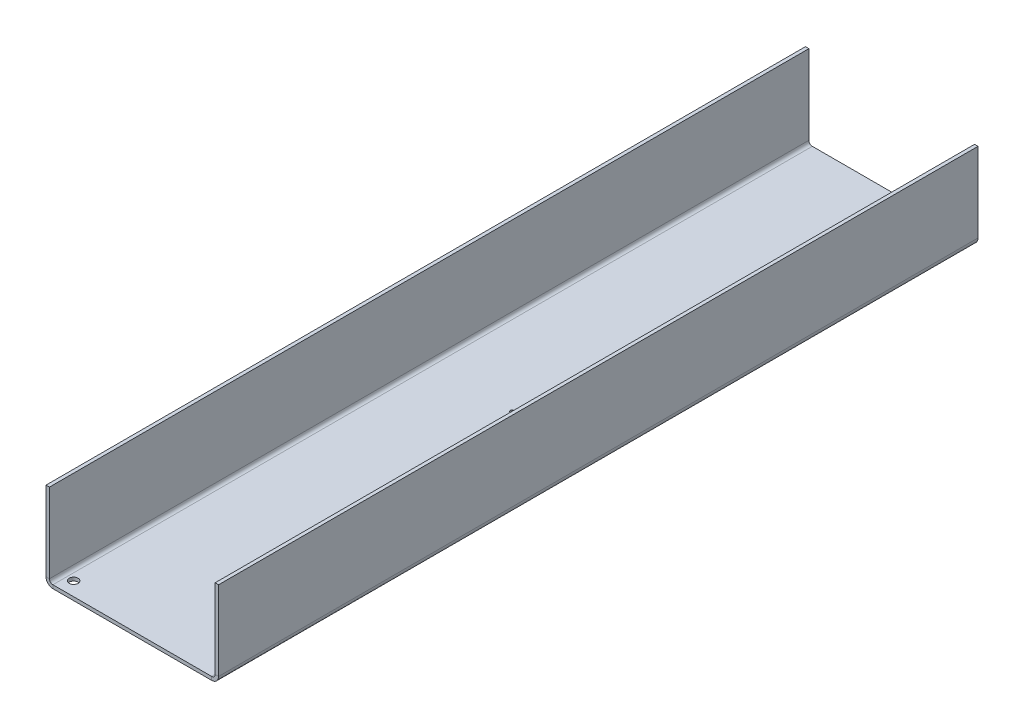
ISO-10303-21;
HEADER;
FILE_DESCRIPTION(('STEP AP214'),'2;1');
FILE_NAME('part.step','',(''),(''),'','','');
FILE_SCHEMA(('AUTOMOTIVE_DESIGN { 1 0 10303 214 1 1 1 1 }'));
ENDSEC;
DATA;
#1=APPLICATION_CONTEXT('core data for automotive mechanical design processes');
#2=APPLICATION_PROTOCOL_DEFINITION('international standard','automotive_design',2000,#1);
#3=PRODUCT_CONTEXT('',#1,'mechanical');
#4=PRODUCT('Part','Part','',(#3));
#5=PRODUCT_RELATED_PRODUCT_CATEGORY('part','',(#4));
#6=PRODUCT_DEFINITION_FORMATION('','',#4);
#7=PRODUCT_DEFINITION_CONTEXT('part definition',#1,'design');
#8=PRODUCT_DEFINITION('design','',#6,#7);
#9=PRODUCT_DEFINITION_SHAPE('','',#8);
#10=(LENGTH_UNIT() NAMED_UNIT(*) SI_UNIT(.MILLI.,.METRE.));
#11=(NAMED_UNIT(*) PLANE_ANGLE_UNIT() SI_UNIT($,.RADIAN.));
#12=(NAMED_UNIT(*) SI_UNIT($,.STERADIAN.) SOLID_ANGLE_UNIT());
#13=UNCERTAINTY_MEASURE_WITH_UNIT(LENGTH_MEASURE(1.E-05),#10,'distance_accuracy_value','');
#14=(GEOMETRIC_REPRESENTATION_CONTEXT(3) GLOBAL_UNCERTAINTY_ASSIGNED_CONTEXT((#13)) GLOBAL_UNIT_ASSIGNED_CONTEXT((#10,
#11,#12)) REPRESENTATION_CONTEXT('',''));
#15=CARTESIAN_POINT('',(0.,0.,0.));
#16=DIRECTION('',(0.,0.,1.));
#17=DIRECTION('',(1.,0.,0.));
#18=AXIS2_PLACEMENT_3D('',#15,#16,#17);
#19=CARTESIAN_POINT('',(0.,-115.,1100.));
#20=DIRECTION('',(0.,0.,1.));
#21=DIRECTION('',(1.,0.,0.));
#22=AXIS2_PLACEMENT_3D('',#19,#20,#21);
#23=PLANE('',#22);
#24=DIRECTION('',(1.,0.,0.));
#25=VECTOR('',#24,1.);
#26=CARTESIAN_POINT('',(0.,-115.,1100.));
#27=LINE('',#26,#25);
#28=CARTESIAN_POINT('',(0.,-115.,1100.));
#29=VERTEX_POINT('',#28);
#30=CARTESIAN_POINT('',(5.00000000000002,-115.,1100.));
#31=VERTEX_POINT('',#30);
#32=EDGE_CURVE('E11',#29,#31,#27,.T.);
#33=ORIENTED_EDGE('',*,*,#32,.F.);
#34=CARTESIAN_POINT('',(10.,-115.,1100.));
#35=DIRECTION('',(0.,0.,1.));
#36=DIRECTION('',(-1.,0.,0.));
#37=AXIS2_PLACEMENT_3D('',#34,#35,#36);
#38=CIRCLE('',#37,9.99999999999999);
#39=CARTESIAN_POINT('',(10.,-125.,1100.));
#40=VERTEX_POINT('',#39);
#41=EDGE_CURVE('E202',#29,#40,#38,.T.);
#42=ORIENTED_EDGE('',*,*,#41,.T.);
#43=DIRECTION('',(0.,-1.,0.));
#44=VECTOR('',#43,1.);
#45=CARTESIAN_POINT('',(10.,-120.,1100.));
#46=LINE('',#45,#44);
#47=CARTESIAN_POINT('',(10.,-120.,1100.));
#48=VERTEX_POINT('',#47);
#49=EDGE_CURVE('E41',#48,#40,#46,.T.);
#50=ORIENTED_EDGE('',*,*,#49,.F.);
#51=CARTESIAN_POINT('',(10.,-115.,1100.));
#52=DIRECTION('',(0.,0.,1.));
#53=DIRECTION('',(1.,0.,0.));
#54=AXIS2_PLACEMENT_3D('',#51,#52,#53);
#55=CIRCLE('',#54,4.99999999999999);
#56=EDGE_CURVE('E190',#31,#48,#55,.T.);
#57=ORIENTED_EDGE('',*,*,#56,.F.);
#58=EDGE_LOOP('',(#33,#42,#50,#57));
#59=FACE_BOUND('',#58,.T.);
#60=ADVANCED_FACE('F34',(#59),#23,.T.);
#61=CARTESIAN_POINT('',(10.,-120.,1100.));
#62=DIRECTION('',(0.,0.,1.));
#63=DIRECTION('',(1.,0.,0.));
#64=AXIS2_PLACEMENT_3D('',#61,#62,#63);
#65=PLANE('',#64);
#66=DIRECTION('',(0.,-1.,0.));
#67=VECTOR('',#66,1.);
#68=CARTESIAN_POINT('',(0.,0.,1100.));
#69=LINE('',#68,#67);
#70=CARTESIAN_POINT('',(0.,0.,1100.));
#71=VERTEX_POINT('',#70);
#72=EDGE_CURVE('E199',#71,#29,#69,.T.);
#73=ORIENTED_EDGE('',*,*,#72,.T.);
#74=ORIENTED_EDGE('',*,*,#32,.T.);
#75=DIRECTION('',(0.,-1.,0.));
#76=VECTOR('',#75,1.);
#77=CARTESIAN_POINT('',(5.,0.,1100.));
#78=LINE('',#77,#76);
#79=CARTESIAN_POINT('',(5.,0.,1100.));
#80=VERTEX_POINT('',#79);
#81=EDGE_CURVE('E193',#80,#31,#78,.T.);
#82=ORIENTED_EDGE('',*,*,#81,.F.);
#83=DIRECTION('',(1.,0.,0.));
#84=VECTOR('',#83,1.);
#85=CARTESIAN_POINT('',(0.,0.,1100.));
#86=LINE('',#85,#84);
#87=EDGE_CURVE('E196',#71,#80,#86,.T.);
#88=ORIENTED_EDGE('',*,*,#87,.F.);
#89=EDGE_LOOP('',(#73,#74,#82,#88));
#90=FACE_BOUND('',#89,.T.);
#91=ADVANCED_FACE('F286',(#90),#65,.T.);
#92=CARTESIAN_POINT('',(10.,-125.,0.));
#93=DIRECTION('',(0.,0.,-1.));
#94=DIRECTION('',(-1.,0.,0.));
#95=AXIS2_PLACEMENT_3D('',#92,#93,#94);
#96=PLANE('',#95);
#97=DIRECTION('',(0.,1.,0.));
#98=VECTOR('',#97,1.);
#99=CARTESIAN_POINT('',(10.,-125.,0.));
#100=LINE('',#99,#98);
#101=CARTESIAN_POINT('',(10.,-125.,0.));
#102=VERTEX_POINT('',#101);
#103=CARTESIAN_POINT('',(10.,-120.,0.));
#104=VERTEX_POINT('',#103);
#105=EDGE_CURVE('E243',#102,#104,#100,.T.);
#106=ORIENTED_EDGE('',*,*,#105,.F.);
#107=CARTESIAN_POINT('',(10.,-115.,0.));
#108=DIRECTION('',(0.,0.,1.));
#109=DIRECTION('',(-1.,0.,0.));
#110=AXIS2_PLACEMENT_3D('',#107,#108,#109);
#111=CIRCLE('',#110,9.99999999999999);
#112=CARTESIAN_POINT('',(0.,-115.,0.));
#113=VERTEX_POINT('',#112);
#114=EDGE_CURVE('E169',#113,#102,#111,.T.);
#115=ORIENTED_EDGE('',*,*,#114,.F.);
#116=DIRECTION('',(-1.,0.,0.));
#117=VECTOR('',#116,1.);
#118=CARTESIAN_POINT('',(5.00000000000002,-115.,0.));
#119=LINE('',#118,#117);
#120=CARTESIAN_POINT('',(5.00000000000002,-115.,0.));
#121=VERTEX_POINT('',#120);
#122=EDGE_CURVE('E241',#121,#113,#119,.T.);
#123=ORIENTED_EDGE('',*,*,#122,.F.);
#124=CARTESIAN_POINT('',(10.,-115.,0.));
#125=DIRECTION('',(0.,0.,1.));
#126=DIRECTION('',(1.,0.,0.));
#127=AXIS2_PLACEMENT_3D('',#124,#125,#126);
#128=CIRCLE('',#127,4.99999999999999);
#129=EDGE_CURVE('E157',#121,#104,#128,.T.);
#130=ORIENTED_EDGE('',*,*,#129,.T.);
#131=EDGE_LOOP('',(#106,#115,#123,#130));
#132=FACE_BOUND('',#131,.T.);
#133=ADVANCED_FACE('F296',(#132),#96,.T.);
#134=CARTESIAN_POINT('',(5.00000000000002,-115.,0.));
#135=DIRECTION('',(0.,0.,-1.));
#136=DIRECTION('',(-1.,0.,0.));
#137=AXIS2_PLACEMENT_3D('',#134,#135,#136);
#138=PLANE('',#137);
#139=DIRECTION('',(1.,0.,0.));
#140=VECTOR('',#139,1.);
#141=CARTESIAN_POINT('',(10.,-125.,0.));
#142=LINE('',#141,#140);
#143=CARTESIAN_POINT('',(240.,-125.,0.));
#144=VERTEX_POINT('',#143);
#145=EDGE_CURVE('E172',#102,#144,#142,.T.);
#146=ORIENTED_EDGE('',*,*,#145,.F.);
#147=ORIENTED_EDGE('',*,*,#105,.T.);
#148=DIRECTION('',(1.,0.,0.));
#149=VECTOR('',#148,1.);
#150=CARTESIAN_POINT('',(10.,-120.,0.));
#151=LINE('',#150,#149);
#152=CARTESIAN_POINT('',(240.,-120.,0.));
#153=VERTEX_POINT('',#152);
#154=EDGE_CURVE('E154',#104,#153,#151,.T.);
#155=ORIENTED_EDGE('',*,*,#154,.T.);
#156=DIRECTION('',(0.,-1.,0.));
#157=VECTOR('',#156,1.);
#158=CARTESIAN_POINT('',(240.,-120.,0.));
#159=LINE('',#158,#157);
#160=EDGE_CURVE('E132',#153,#144,#159,.T.);
#161=ORIENTED_EDGE('',*,*,#160,.T.);
#162=EDGE_LOOP('',(#146,#147,#155,#161));
#163=FACE_BOUND('',#162,.T.);
#164=ADVANCED_FACE('F298',(#163),#138,.T.);
#165=CARTESIAN_POINT('',(240.,-125.,1100.));
#166=DIRECTION('',(0.,0.,1.));
#167=DIRECTION('',(1.,0.,0.));
#168=AXIS2_PLACEMENT_3D('',#165,#166,#167);
#169=PLANE('',#168);
#170=DIRECTION('',(0.,1.,0.));
#171=VECTOR('',#170,1.);
#172=CARTESIAN_POINT('',(240.,-125.,1100.));
#173=LINE('',#172,#171);
#174=CARTESIAN_POINT('',(240.,-125.,1100.));
#175=VERTEX_POINT('',#174);
#176=CARTESIAN_POINT('',(240.,-120.,1100.));
#177=VERTEX_POINT('',#176);
#178=EDGE_CURVE('E55',#175,#177,#173,.T.);
#179=ORIENTED_EDGE('',*,*,#178,.F.);
#180=CARTESIAN_POINT('',(240.,-115.,1100.));
#181=DIRECTION('',(0.,0.,1.));
#182=DIRECTION('',(-1.,0.,0.));
#183=AXIS2_PLACEMENT_3D('',#180,#181,#182);
#184=CIRCLE('',#183,10.);
#185=CARTESIAN_POINT('',(250.,-115.,1100.));
#186=VERTEX_POINT('',#185);
#187=EDGE_CURVE('E207',#175,#186,#184,.T.);
#188=ORIENTED_EDGE('',*,*,#187,.T.);
#189=DIRECTION('',(1.,0.,0.));
#190=VECTOR('',#189,1.);
#191=CARTESIAN_POINT('',(245.,-115.,1100.));
#192=LINE('',#191,#190);
#193=CARTESIAN_POINT('',(245.,-115.,1100.));
#194=VERTEX_POINT('',#193);
#195=EDGE_CURVE('E48',#194,#186,#192,.T.);
#196=ORIENTED_EDGE('',*,*,#195,.F.);
#197=CARTESIAN_POINT('',(240.,-115.,1100.));
#198=DIRECTION('',(0.,0.,1.));
#199=DIRECTION('',(1.,0.,0.));
#200=AXIS2_PLACEMENT_3D('',#197,#198,#199);
#201=CIRCLE('',#200,5.);
#202=EDGE_CURVE('E184',#177,#194,#201,.T.);
#203=ORIENTED_EDGE('',*,*,#202,.F.);
#204=EDGE_LOOP('',(#179,#188,#196,#203));
#205=FACE_BOUND('',#204,.T.);
#206=ADVANCED_FACE('F264',(#205),#169,.T.);
#207=CARTESIAN_POINT('',(245.,-115.,1100.));
#208=DIRECTION('',(0.,0.,1.));
#209=DIRECTION('',(1.,0.,0.));
#210=AXIS2_PLACEMENT_3D('',#207,#208,#209);
#211=PLANE('',#210);
#212=DIRECTION('',(1.,0.,0.));
#213=VECTOR('',#212,1.);
#214=CARTESIAN_POINT('',(10.,-125.,1100.));
#215=LINE('',#214,#213);
#216=EDGE_CURVE('E205',#40,#175,#215,.T.);
#217=ORIENTED_EDGE('',*,*,#216,.T.);
#218=ORIENTED_EDGE('',*,*,#178,.T.);
#219=DIRECTION('',(1.,0.,0.));
#220=VECTOR('',#219,1.);
#221=CARTESIAN_POINT('',(10.,-120.,1100.));
#222=LINE('',#221,#220);
#223=EDGE_CURVE('E187',#48,#177,#222,.T.);
#224=ORIENTED_EDGE('',*,*,#223,.F.);
#225=ORIENTED_EDGE('',*,*,#49,.T.);
#226=EDGE_LOOP('',(#217,#218,#224,#225));
#227=FACE_BOUND('',#226,.T.);
#228=ADVANCED_FACE('F246',(#227),#211,.T.);
#229=CARTESIAN_POINT('',(250.,-115.,0.));
#230=DIRECTION('',(0.,0.,-1.));
#231=DIRECTION('',(-1.,0.,0.));
#232=AXIS2_PLACEMENT_3D('',#229,#230,#231);
#233=PLANE('',#232);
#234=DIRECTION('',(-1.,0.,0.));
#235=VECTOR('',#234,1.);
#236=CARTESIAN_POINT('',(250.,-115.,0.));
#237=LINE('',#236,#235);
#238=CARTESIAN_POINT('',(250.,-115.,0.));
#239=VERTEX_POINT('',#238);
#240=CARTESIAN_POINT('',(245.,-115.,0.));
#241=VERTEX_POINT('',#240);
#242=EDGE_CURVE('E237',#239,#241,#237,.T.);
#243=ORIENTED_EDGE('',*,*,#242,.F.);
#244=CARTESIAN_POINT('',(240.,-115.,0.));
#245=DIRECTION('',(0.,0.,1.));
#246=DIRECTION('',(-1.,0.,0.));
#247=AXIS2_PLACEMENT_3D('',#244,#245,#246);
#248=CIRCLE('',#247,10.);
#249=EDGE_CURVE('E175',#144,#239,#248,.T.);
#250=ORIENTED_EDGE('',*,*,#249,.F.);
#251=ORIENTED_EDGE('',*,*,#160,.F.);
#252=CARTESIAN_POINT('',(240.,-115.,0.));
#253=DIRECTION('',(0.,0.,1.));
#254=DIRECTION('',(1.,0.,0.));
#255=AXIS2_PLACEMENT_3D('',#252,#253,#254);
#256=CIRCLE('',#255,5.);
#257=EDGE_CURVE('E148',#153,#241,#256,.T.);
#258=ORIENTED_EDGE('',*,*,#257,.T.);
#259=EDGE_LOOP('',(#243,#250,#251,#258));
#260=FACE_BOUND('',#259,.T.);
#261=ADVANCED_FACE('F300',(#260),#233,.T.);
#262=CARTESIAN_POINT('',(240.,-120.,0.));
#263=DIRECTION('',(0.,0.,-1.));
#264=DIRECTION('',(-1.,0.,0.));
#265=AXIS2_PLACEMENT_3D('',#262,#263,#264);
#266=PLANE('',#265);
#267=DIRECTION('',(0.,1.,0.));
#268=VECTOR('',#267,1.);
#269=CARTESIAN_POINT('',(250.,-115.,0.));
#270=LINE('',#269,#268);
#271=CARTESIAN_POINT('',(250.,0.,0.));
#272=VERTEX_POINT('',#271);
#273=EDGE_CURVE('E137',#239,#272,#270,.T.);
#274=ORIENTED_EDGE('',*,*,#273,.F.);
#275=ORIENTED_EDGE('',*,*,#242,.T.);
#276=DIRECTION('',(0.,1.,0.));
#277=VECTOR('',#276,1.);
#278=CARTESIAN_POINT('',(245.,-115.,0.));
#279=LINE('',#278,#277);
#280=CARTESIAN_POINT('',(245.,0.,0.));
#281=VERTEX_POINT('',#280);
#282=EDGE_CURVE('E146',#241,#281,#279,.T.);
#283=ORIENTED_EDGE('',*,*,#282,.T.);
#284=DIRECTION('',(1.,0.,0.));
#285=VECTOR('',#284,1.);
#286=CARTESIAN_POINT('',(245.,0.,0.));
#287=LINE('',#286,#285);
#288=EDGE_CURVE('E126',#281,#272,#287,.T.);
#289=ORIENTED_EDGE('',*,*,#288,.T.);
#290=EDGE_LOOP('',(#274,#275,#283,#289));
#291=FACE_BOUND('',#290,.T.);
#292=ADVANCED_FACE('F144',(#291),#266,.T.);
#293=CARTESIAN_POINT('',(250.,-115.,1100.));
#294=DIRECTION('',(-1.,0.,0.));
#295=DIRECTION('',(0.,0.,1.));
#296=AXIS2_PLACEMENT_3D('',#293,#294,#295);
#297=PLANE('',#296);
#298=ORIENTED_EDGE('',*,*,#273,.T.);
#299=DIRECTION('',(0.,0.,-1.));
#300=VECTOR('',#299,1.);
#301=CARTESIAN_POINT('',(250.,0.,1100.));
#302=LINE('',#301,#300);
#303=CARTESIAN_POINT('',(250.,0.,1100.));
#304=VERTEX_POINT('',#303);
#305=EDGE_CURVE('E122',#304,#272,#302,.T.);
#306=ORIENTED_EDGE('',*,*,#305,.F.);
#307=DIRECTION('',(0.,1.,0.));
#308=VECTOR('',#307,1.);
#309=CARTESIAN_POINT('',(250.,-115.,1100.));
#310=LINE('',#309,#308);
#311=EDGE_CURVE('E178',#186,#304,#310,.T.);
#312=ORIENTED_EDGE('',*,*,#311,.F.);
#313=DIRECTION('',(0.,0.,-1.));
#314=VECTOR('',#313,1.);
#315=CARTESIAN_POINT('',(250.,-115.,1100.));
#316=LINE('',#315,#314);
#317=EDGE_CURVE('E140',#186,#239,#316,.T.);
#318=ORIENTED_EDGE('',*,*,#317,.T.);
#319=EDGE_LOOP('',(#298,#306,#312,#318));
#320=FACE_BOUND('',#319,.T.);
#321=ADVANCED_FACE('F138',(#320),#297,.F.);
#322=CARTESIAN_POINT('',(245.,0.,1100.));
#323=DIRECTION('',(0.,1.,0.));
#324=DIRECTION('',(0.,0.,1.));
#325=AXIS2_PLACEMENT_3D('',#322,#323,#324);
#326=PLANE('',#325);
#327=ORIENTED_EDGE('',*,*,#288,.F.);
#328=DIRECTION('',(0.,0.,-1.));
#329=VECTOR('',#328,1.);
#330=CARTESIAN_POINT('',(245.,0.,1100.));
#331=LINE('',#330,#329);
#332=CARTESIAN_POINT('',(245.,0.,1100.));
#333=VERTEX_POINT('',#332);
#334=EDGE_CURVE('E133',#333,#281,#331,.T.);
#335=ORIENTED_EDGE('',*,*,#334,.F.);
#336=DIRECTION('',(1.,0.,0.));
#337=VECTOR('',#336,1.);
#338=CARTESIAN_POINT('',(245.,0.,1100.));
#339=LINE('',#338,#337);
#340=EDGE_CURVE('E129',#333,#304,#339,.T.);
#341=ORIENTED_EDGE('',*,*,#340,.T.);
#342=ORIENTED_EDGE('',*,*,#305,.T.);
#343=EDGE_LOOP('',(#327,#335,#341,#342));
#344=FACE_BOUND('',#343,.T.);
#345=ADVANCED_FACE('F124',(#344),#326,.T.);
#346=CARTESIAN_POINT('',(245.,-115.,1100.));
#347=DIRECTION('',(-1.,0.,0.));
#348=DIRECTION('',(0.,0.,1.));
#349=AXIS2_PLACEMENT_3D('',#346,#347,#348);
#350=PLANE('',#349);
#351=ORIENTED_EDGE('',*,*,#282,.F.);
#352=DIRECTION('',(0.,0.,-1.));
#353=VECTOR('',#352,1.);
#354=CARTESIAN_POINT('',(245.,-115.,1100.));
#355=LINE('',#354,#353);
#356=EDGE_CURVE('E232',#194,#241,#355,.T.);
#357=ORIENTED_EDGE('',*,*,#356,.F.);
#358=DIRECTION('',(0.,1.,0.));
#359=VECTOR('',#358,1.);
#360=CARTESIAN_POINT('',(245.,-115.,1100.));
#361=LINE('',#360,#359);
#362=EDGE_CURVE('E181',#194,#333,#361,.T.);
#363=ORIENTED_EDGE('',*,*,#362,.T.);
#364=ORIENTED_EDGE('',*,*,#334,.T.);
#365=EDGE_LOOP('',(#351,#357,#363,#364));
#366=FACE_BOUND('',#365,.T.);
#367=ADVANCED_FACE('F267',(#366),#350,.T.);
#368=CARTESIAN_POINT('',(240.,-115.,1100.));
#369=DIRECTION('',(0.,0.,-1.));
#370=DIRECTION('',(-1.,0.,0.));
#371=AXIS2_PLACEMENT_3D('',#368,#369,#370);
#372=CYLINDRICAL_SURFACE('',#371,5.);
#373=ORIENTED_EDGE('',*,*,#257,.F.);
#374=DIRECTION('',(0.,0.,-1.));
#375=VECTOR('',#374,1.);
#376=CARTESIAN_POINT('',(240.,-120.,1100.));
#377=LINE('',#376,#375);
#378=EDGE_CURVE('E229',#177,#153,#377,.T.);
#379=ORIENTED_EDGE('',*,*,#378,.F.);
#380=ORIENTED_EDGE('',*,*,#202,.T.);
#381=ORIENTED_EDGE('',*,*,#356,.T.);
#382=EDGE_LOOP('',(#373,#379,#380,#381));
#383=FACE_BOUND('',#382,.T.);
#384=ADVANCED_FACE('F272',(#383),#372,.F.);
#385=CARTESIAN_POINT('',(10.,-120.,1100.));
#386=DIRECTION('',(0.,1.,0.));
#387=DIRECTION('',(-1.,0.,0.));
#388=AXIS2_PLACEMENT_3D('',#385,#386,#387);
#389=PLANE('',#388);
#390=CARTESIAN_POINT('',(125.,-120.,550.));
#391=DIRECTION('',(0.,1.,0.));
#392=DIRECTION('',(-1.,0.,0.));
#393=AXIS2_PLACEMENT_3D('',#390,#391,#392);
#394=CIRCLE('',#393,2.5);
#395=CARTESIAN_POINT('',(122.5,-120.,550.));
#396=VERTEX_POINT('',#395);
#397=EDGE_CURVE('E550',#396,#396,#394,.T.);
#398=ORIENTED_EDGE('',*,*,#397,.F.);
#399=EDGE_LOOP('',(#398));
#400=FACE_BOUND('',#399,.T.);
#401=CARTESIAN_POINT('',(20.,-120.,1080.));
#402=DIRECTION('',(0.,1.,0.));
#403=DIRECTION('',(-1.,0.,0.));
#404=AXIS2_PLACEMENT_3D('',#401,#402,#403);
#405=CIRCLE('',#404,6.49999999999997);
#406=CARTESIAN_POINT('',(13.5,-120.,1080.));
#407=VERTEX_POINT('',#406);
#408=EDGE_CURVE('E142',#407,#407,#405,.T.);
#409=ORIENTED_EDGE('',*,*,#408,.F.);
#410=EDGE_LOOP('',(#409));
#411=FACE_BOUND('',#410,.T.);
#412=ORIENTED_EDGE('',*,*,#154,.F.);
#413=DIRECTION('',(0.,0.,-1.));
#414=VECTOR('',#413,1.);
#415=CARTESIAN_POINT('',(10.,-120.,1100.));
#416=LINE('',#415,#414);
#417=EDGE_CURVE('E226',#48,#104,#416,.T.);
#418=ORIENTED_EDGE('',*,*,#417,.F.);
#419=ORIENTED_EDGE('',*,*,#223,.T.);
#420=ORIENTED_EDGE('',*,*,#378,.T.);
#421=EDGE_LOOP('',(#412,#418,#419,#420));
#422=FACE_BOUND('',#421,.T.);
#423=ADVANCED_FACE('F275',(#400,#411,#422),#389,.T.);
#424=CARTESIAN_POINT('',(10.,-115.,1100.));
#425=DIRECTION('',(0.,0.,-1.));
#426=DIRECTION('',(-1.,0.,0.));
#427=AXIS2_PLACEMENT_3D('',#424,#425,#426);
#428=CYLINDRICAL_SURFACE('',#427,4.99999999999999);
#429=ORIENTED_EDGE('',*,*,#129,.F.);
#430=DIRECTION('',(0.,0.,-1.));
#431=VECTOR('',#430,1.);
#432=CARTESIAN_POINT('',(5.00000000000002,-115.,1100.));
#433=LINE('',#432,#431);
#434=EDGE_CURVE('E223',#31,#121,#433,.T.);
#435=ORIENTED_EDGE('',*,*,#434,.F.);
#436=ORIENTED_EDGE('',*,*,#56,.T.);
#437=ORIENTED_EDGE('',*,*,#417,.T.);
#438=EDGE_LOOP('',(#429,#435,#436,#437));
#439=FACE_BOUND('',#438,.T.);
#440=ADVANCED_FACE('F278',(#439),#428,.F.);
#441=CARTESIAN_POINT('',(5.,0.,1100.));
#442=DIRECTION('',(1.,0.,0.));
#443=DIRECTION('',(0.,1.,0.));
#444=AXIS2_PLACEMENT_3D('',#441,#442,#443);
#445=PLANE('',#444);
#446=DIRECTION('',(0.,-1.,0.));
#447=VECTOR('',#446,1.);
#448=CARTESIAN_POINT('',(5.,0.,0.));
#449=LINE('',#448,#447);
#450=CARTESIAN_POINT('',(5.,0.,0.));
#451=VERTEX_POINT('',#450);
#452=EDGE_CURVE('E160',#451,#121,#449,.T.);
#453=ORIENTED_EDGE('',*,*,#452,.F.);
#454=DIRECTION('',(0.,0.,-1.));
#455=VECTOR('',#454,1.);
#456=CARTESIAN_POINT('',(5.,0.,1100.));
#457=LINE('',#456,#455);
#458=EDGE_CURVE('E221',#80,#451,#457,.T.);
#459=ORIENTED_EDGE('',*,*,#458,.F.);
#460=ORIENTED_EDGE('',*,*,#81,.T.);
#461=ORIENTED_EDGE('',*,*,#434,.T.);
#462=EDGE_LOOP('',(#453,#459,#460,#461));
#463=FACE_BOUND('',#462,.T.);
#464=ADVANCED_FACE('F283',(#463),#445,.T.);
#465=CARTESIAN_POINT('',(0.,0.,1100.));
#466=DIRECTION('',(0.,1.,0.));
#467=DIRECTION('',(-1.,0.,0.));
#468=AXIS2_PLACEMENT_3D('',#465,#466,#467);
#469=PLANE('',#468);
#470=DIRECTION('',(1.,0.,0.));
#471=VECTOR('',#470,1.);
#472=CARTESIAN_POINT('',(0.,0.,0.));
#473=LINE('',#472,#471);
#474=CARTESIAN_POINT('',(0.,0.,0.));
#475=VERTEX_POINT('',#474);
#476=EDGE_CURVE('E163',#475,#451,#473,.T.);
#477=ORIENTED_EDGE('',*,*,#476,.F.);
#478=DIRECTION('',(0.,0.,-1.));
#479=VECTOR('',#478,1.);
#480=CARTESIAN_POINT('',(0.,0.,1100.));
#481=LINE('',#480,#479);
#482=EDGE_CURVE('E219',#71,#475,#481,.T.);
#483=ORIENTED_EDGE('',*,*,#482,.F.);
#484=ORIENTED_EDGE('',*,*,#87,.T.);
#485=ORIENTED_EDGE('',*,*,#458,.T.);
#486=EDGE_LOOP('',(#477,#483,#484,#485));
#487=FACE_BOUND('',#486,.T.);
#488=ADVANCED_FACE('F289',(#487),#469,.T.);
#489=CARTESIAN_POINT('',(0.,0.,1100.));
#490=DIRECTION('',(1.,0.,0.));
#491=DIRECTION('',(0.,1.,0.));
#492=AXIS2_PLACEMENT_3D('',#489,#490,#491);
#493=PLANE('',#492);
#494=DIRECTION('',(0.,-1.,0.));
#495=VECTOR('',#494,1.);
#496=CARTESIAN_POINT('',(0.,0.,0.));
#497=LINE('',#496,#495);
#498=EDGE_CURVE('E166',#475,#113,#497,.T.);
#499=ORIENTED_EDGE('',*,*,#498,.T.);
#500=DIRECTION('',(0.,0.,-1.));
#501=VECTOR('',#500,1.);
#502=CARTESIAN_POINT('',(0.,-115.,1100.));
#503=LINE('',#502,#501);
#504=EDGE_CURVE('E216',#29,#113,#503,.T.);
#505=ORIENTED_EDGE('',*,*,#504,.F.);
#506=ORIENTED_EDGE('',*,*,#72,.F.);
#507=ORIENTED_EDGE('',*,*,#482,.T.);
#508=EDGE_LOOP('',(#499,#505,#506,#507));
#509=FACE_BOUND('',#508,.T.);
#510=ADVANCED_FACE('F294',(#509),#493,.F.);
#511=CARTESIAN_POINT('',(10.,-115.,1100.));
#512=DIRECTION('',(0.,0.,-1.));
#513=DIRECTION('',(-1.,0.,0.));
#514=AXIS2_PLACEMENT_3D('',#511,#512,#513);
#515=CYLINDRICAL_SURFACE('',#514,9.99999999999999);
#516=ORIENTED_EDGE('',*,*,#114,.T.);
#517=DIRECTION('',(0.,0.,-1.));
#518=VECTOR('',#517,1.);
#519=CARTESIAN_POINT('',(10.,-125.,1100.));
#520=LINE('',#519,#518);
#521=EDGE_CURVE('E213',#40,#102,#520,.T.);
#522=ORIENTED_EDGE('',*,*,#521,.F.);
#523=ORIENTED_EDGE('',*,*,#41,.F.);
#524=ORIENTED_EDGE('',*,*,#504,.T.);
#525=EDGE_LOOP('',(#516,#522,#523,#524));
#526=FACE_BOUND('',#525,.T.);
#527=ADVANCED_FACE('F255',(#526),#515,.T.);
#528=CARTESIAN_POINT('',(10.,-125.,1100.));
#529=DIRECTION('',(0.,1.,0.));
#530=DIRECTION('',(-1.,0.,0.));
#531=AXIS2_PLACEMENT_3D('',#528,#529,#530);
#532=PLANE('',#531);
#533=CARTESIAN_POINT('',(125.,-125.,550.));
#534=DIRECTION('',(0.,-1.,0.));
#535=DIRECTION('',(1.,0.,0.));
#536=AXIS2_PLACEMENT_3D('',#533,#534,#535);
#537=CIRCLE('',#536,2.5);
#538=CARTESIAN_POINT('',(127.5,-125.,550.));
#539=VERTEX_POINT('',#538);
#540=EDGE_CURVE('E553',#539,#539,#537,.T.);
#541=ORIENTED_EDGE('',*,*,#540,.F.);
#542=EDGE_LOOP('',(#541));
#543=FACE_BOUND('',#542,.T.);
#544=CARTESIAN_POINT('',(20.,-125.,1080.));
#545=DIRECTION('',(0.,-1.,0.));
#546=DIRECTION('',(1.,0.,0.));
#547=AXIS2_PLACEMENT_3D('',#544,#545,#546);
#548=CIRCLE('',#547,6.49999999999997);
#549=CARTESIAN_POINT('',(26.5,-125.,1080.));
#550=VERTEX_POINT('',#549);
#551=EDGE_CURVE('E555',#550,#550,#548,.T.);
#552=ORIENTED_EDGE('',*,*,#551,.F.);
#553=EDGE_LOOP('',(#552));
#554=FACE_BOUND('',#553,.T.);
#555=ORIENTED_EDGE('',*,*,#145,.T.);
#556=DIRECTION('',(0.,0.,-1.));
#557=VECTOR('',#556,1.);
#558=CARTESIAN_POINT('',(240.,-125.,1100.));
#559=LINE('',#558,#557);
#560=EDGE_CURVE('E210',#175,#144,#559,.T.);
#561=ORIENTED_EDGE('',*,*,#560,.F.);
#562=ORIENTED_EDGE('',*,*,#216,.F.);
#563=ORIENTED_EDGE('',*,*,#521,.T.);
#564=EDGE_LOOP('',(#555,#561,#562,#563));
#565=FACE_BOUND('',#564,.T.);
#566=ADVANCED_FACE('F259',(#543,#554,#565),#532,.F.);
#567=CARTESIAN_POINT('',(240.,-115.,1100.));
#568=DIRECTION('',(0.,0.,-1.));
#569=DIRECTION('',(-1.,0.,0.));
#570=AXIS2_PLACEMENT_3D('',#567,#568,#569);
#571=CYLINDRICAL_SURFACE('',#570,10.);
#572=ORIENTED_EDGE('',*,*,#249,.T.);
#573=ORIENTED_EDGE('',*,*,#317,.F.);
#574=ORIENTED_EDGE('',*,*,#187,.F.);
#575=ORIENTED_EDGE('',*,*,#560,.T.);
#576=EDGE_LOOP('',(#572,#573,#574,#575));
#577=FACE_BOUND('',#576,.T.);
#578=ADVANCED_FACE('F263',(#577),#571,.T.);
#579=CARTESIAN_POINT('',(240.,-115.,1100.));
#580=DIRECTION('',(0.,0.,1.));
#581=DIRECTION('',(1.,0.,0.));
#582=AXIS2_PLACEMENT_3D('',#579,#580,#581);
#583=PLANE('',#582);
#584=ORIENTED_EDGE('',*,*,#311,.T.);
#585=ORIENTED_EDGE('',*,*,#340,.F.);
#586=ORIENTED_EDGE('',*,*,#362,.F.);
#587=ORIENTED_EDGE('',*,*,#195,.T.);
#588=EDGE_LOOP('',(#584,#585,#586,#587));
#589=FACE_BOUND('',#588,.T.);
#590=ADVANCED_FACE('F270',(#589),#583,.T.);
#591=CARTESIAN_POINT('',(240.,-115.,0.));
#592=DIRECTION('',(0.,0.,1.));
#593=DIRECTION('',(1.,0.,0.));
#594=AXIS2_PLACEMENT_3D('',#591,#592,#593);
#595=PLANE('',#594);
#596=ORIENTED_EDGE('',*,*,#452,.T.);
#597=ORIENTED_EDGE('',*,*,#122,.T.);
#598=ORIENTED_EDGE('',*,*,#498,.F.);
#599=ORIENTED_EDGE('',*,*,#476,.T.);
#600=EDGE_LOOP('',(#596,#597,#598,#599));
#601=FACE_BOUND('',#600,.T.);
#602=ADVANCED_FACE('F445',(#601),#595,.F.);
#603=CARTESIAN_POINT('',(20.,0.,1080.));
#604=DIRECTION('',(0.,-1.,0.));
#605=DIRECTION('',(1.,0.,0.));
#606=AXIS2_PLACEMENT_3D('',#603,#604,#605);
#607=CYLINDRICAL_SURFACE('',#606,6.49999999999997);
#608=ORIENTED_EDGE('',*,*,#408,.T.);
#609=EDGE_LOOP('',(#608));
#610=FACE_BOUND('',#609,.T.);
#611=ORIENTED_EDGE('',*,*,#551,.T.);
#612=EDGE_LOOP('',(#611));
#613=FACE_BOUND('',#612,.T.);
#614=ADVANCED_FACE('F455',(#610,#613),#607,.F.);
#615=CARTESIAN_POINT('',(125.,0.,550.));
#616=DIRECTION('',(0.,-1.,0.));
#617=DIRECTION('',(1.,0.,0.));
#618=AXIS2_PLACEMENT_3D('',#615,#616,#617);
#619=CYLINDRICAL_SURFACE('',#618,2.5);
#620=ORIENTED_EDGE('',*,*,#397,.T.);
#621=EDGE_LOOP('',(#620));
#622=FACE_BOUND('',#621,.T.);
#623=ORIENTED_EDGE('',*,*,#540,.T.);
#624=EDGE_LOOP('',(#623));
#625=FACE_BOUND('',#624,.T.);
#626=ADVANCED_FACE('F482',(#622,#625),#619,.F.);
#627=CLOSED_SHELL('',(#60,#91,#133,#164,#206,#228,#261,#292,#321,#345,#367,#384,#423,#440,#464,
#488,#510,#527,#566,#578,#590,#602,#614,#626));
#628=MANIFOLD_SOLID_BREP('B2',#627);
#629=ADVANCED_BREP_SHAPE_REPRESENTATION('',(#18,#628),#14);
#630=SHAPE_DEFINITION_REPRESENTATION(#9,#629);
ENDSEC;
END-ISO-10303-21;
